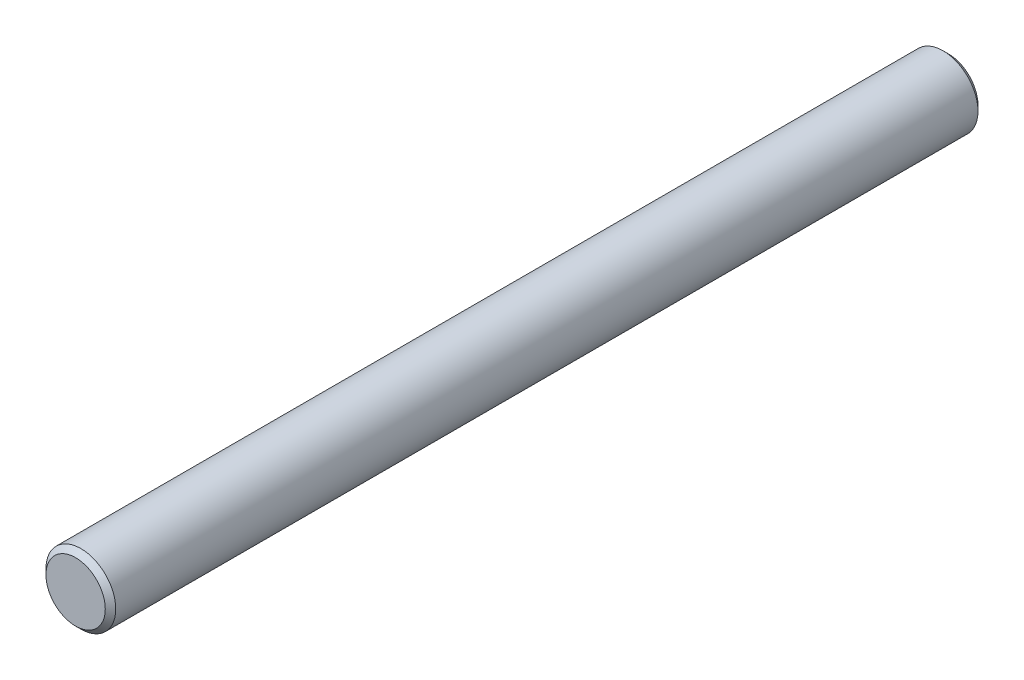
ISO-10303-21;
HEADER;
FILE_DESCRIPTION(('STEP AP214'),'2;1');
FILE_NAME('part.step','',(''),(''),'','','');
FILE_SCHEMA(('AUTOMOTIVE_DESIGN { 1 0 10303 214 1 1 1 1 }'));
ENDSEC;
DATA;
#1=APPLICATION_CONTEXT('core data for automotive mechanical design processes');
#2=APPLICATION_PROTOCOL_DEFINITION('international standard','automotive_design',2000,#1);
#3=PRODUCT_CONTEXT('',#1,'mechanical');
#4=PRODUCT('Part','Part','',(#3));
#5=PRODUCT_RELATED_PRODUCT_CATEGORY('part','',(#4));
#6=PRODUCT_DEFINITION_FORMATION('','',#4);
#7=PRODUCT_DEFINITION_CONTEXT('part definition',#1,'design');
#8=PRODUCT_DEFINITION('design','',#6,#7);
#9=PRODUCT_DEFINITION_SHAPE('','',#8);
#10=(LENGTH_UNIT() NAMED_UNIT(*) SI_UNIT(.MILLI.,.METRE.));
#11=(NAMED_UNIT(*) PLANE_ANGLE_UNIT() SI_UNIT($,.RADIAN.));
#12=(NAMED_UNIT(*) SI_UNIT($,.STERADIAN.) SOLID_ANGLE_UNIT());
#13=UNCERTAINTY_MEASURE_WITH_UNIT(LENGTH_MEASURE(1.E-05),#10,'distance_accuracy_value','');
#14=(GEOMETRIC_REPRESENTATION_CONTEXT(3) GLOBAL_UNCERTAINTY_ASSIGNED_CONTEXT((#13)) GLOBAL_UNIT_ASSIGNED_CONTEXT((#10,
#11,#12)) REPRESENTATION_CONTEXT('',''));
#15=CARTESIAN_POINT('',(0.,0.,0.));
#16=DIRECTION('',(0.,0.,1.));
#17=DIRECTION('',(1.,0.,0.));
#18=AXIS2_PLACEMENT_3D('',#15,#16,#17);
#19=CARTESIAN_POINT('',(0.,0.,50.));
#20=DIRECTION('',(0.,0.,-1.));
#21=DIRECTION('',(-1.,0.,0.));
#22=AXIS2_PLACEMENT_3D('',#19,#20,#21);
#23=CYLINDRICAL_SURFACE('',#22,2.);
#24=CARTESIAN_POINT('',(0.,0.,0.300000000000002));
#25=DIRECTION('',(0.,0.,1.));
#26=DIRECTION('',(1.,0.,0.));
#27=AXIS2_PLACEMENT_3D('',#24,#25,#26);
#28=CIRCLE('',#27,2.);
#29=CARTESIAN_POINT('',(2.,0.,0.300000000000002));
#30=VERTEX_POINT('',#29);
#31=EDGE_CURVE('E43',#30,#30,#28,.T.);
#32=ORIENTED_EDGE('',*,*,#31,.T.);
#33=EDGE_LOOP('',(#32));
#34=FACE_BOUND('',#33,.T.);
#35=CARTESIAN_POINT('',(0.,0.,49.7));
#36=DIRECTION('',(0.,0.,1.));
#37=DIRECTION('',(1.,0.,0.));
#38=AXIS2_PLACEMENT_3D('',#35,#36,#37);
#39=CIRCLE('',#38,2.);
#40=CARTESIAN_POINT('',(2.,0.,49.7));
#41=VERTEX_POINT('',#40);
#42=EDGE_CURVE('E47',#41,#41,#39,.F.);
#43=ORIENTED_EDGE('',*,*,#42,.T.);
#44=EDGE_LOOP('',(#43));
#45=FACE_BOUND('',#44,.T.);
#46=ADVANCED_FACE('F32',(#34,#45),#23,.T.);
#47=CARTESIAN_POINT('',(0.,0.,50.));
#48=DIRECTION('',(0.,0.,1.));
#49=DIRECTION('',(1.,0.,0.));
#50=AXIS2_PLACEMENT_3D('',#47,#48,#49);
#51=PLANE('',#50);
#52=CARTESIAN_POINT('',(0.,0.,50.));
#53=DIRECTION('',(0.,0.,1.));
#54=DIRECTION('',(1.,0.,0.));
#55=AXIS2_PLACEMENT_3D('',#52,#53,#54);
#56=CIRCLE('',#55,1.69999999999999);
#57=CARTESIAN_POINT('',(1.69999999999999,0.,50.));
#58=VERTEX_POINT('',#57);
#59=EDGE_CURVE('E10',#58,#58,#56,.T.);
#60=ORIENTED_EDGE('',*,*,#59,.T.);
#61=EDGE_LOOP('',(#60));
#62=FACE_BOUND('',#61,.T.);
#63=ADVANCED_FACE('F63',(#62),#51,.T.);
#64=CARTESIAN_POINT('',(0.,0.,0.));
#65=DIRECTION('',(0.,0.,1.));
#66=DIRECTION('',(1.,0.,0.));
#67=AXIS2_PLACEMENT_3D('',#64,#65,#66);
#68=PLANE('',#67);
#69=CARTESIAN_POINT('',(0.,0.,0.));
#70=DIRECTION('',(0.,0.,1.));
#71=DIRECTION('',(1.,0.,0.));
#72=AXIS2_PLACEMENT_3D('',#69,#70,#71);
#73=CIRCLE('',#72,1.70000000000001);
#74=CARTESIAN_POINT('',(1.70000000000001,0.,0.));
#75=VERTEX_POINT('',#74);
#76=EDGE_CURVE('E39',#75,#75,#73,.F.);
#77=ORIENTED_EDGE('',*,*,#76,.T.);
#78=EDGE_LOOP('',(#77));
#79=FACE_BOUND('',#78,.T.);
#80=ADVANCED_FACE('F60',(#79),#68,.F.);
#81=CARTESIAN_POINT('',(0.,0.,0.300000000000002));
#82=DIRECTION('',(0.,0.,1.));
#83=DIRECTION('',(1.,0.,0.));
#84=AXIS2_PLACEMENT_3D('',#81,#82,#83);
#85=CONICAL_SURFACE('',#84,2.,0.785398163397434);
#86=ORIENTED_EDGE('',*,*,#76,.F.);
#87=EDGE_LOOP('',(#86));
#88=FACE_BOUND('',#87,.T.);
#89=ORIENTED_EDGE('',*,*,#31,.F.);
#90=EDGE_LOOP('',(#89));
#91=FACE_BOUND('',#90,.T.);
#92=ADVANCED_FACE('F56',(#88,#91),#85,.T.);
#93=CARTESIAN_POINT('',(0.,0.,50.));
#94=DIRECTION('',(0.,0.,-1.));
#95=DIRECTION('',(-1.,0.,0.));
#96=AXIS2_PLACEMENT_3D('',#93,#94,#95);
#97=CONICAL_SURFACE('',#96,1.69999999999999,0.785398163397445);
#98=ORIENTED_EDGE('',*,*,#42,.F.);
#99=EDGE_LOOP('',(#98));
#100=FACE_BOUND('',#99,.T.);
#101=ORIENTED_EDGE('',*,*,#59,.F.);
#102=EDGE_LOOP('',(#101));
#103=FACE_BOUND('',#102,.T.);
#104=ADVANCED_FACE('F34',(#100,#103),#97,.T.);
#105=CLOSED_SHELL('',(#46,#63,#80,#92,#104));
#106=MANIFOLD_SOLID_BREP('B2',#105);
#107=ADVANCED_BREP_SHAPE_REPRESENTATION('',(#18,#106),#14);
#108=SHAPE_DEFINITION_REPRESENTATION(#9,#107);
ENDSEC;
END-ISO-10303-21;
